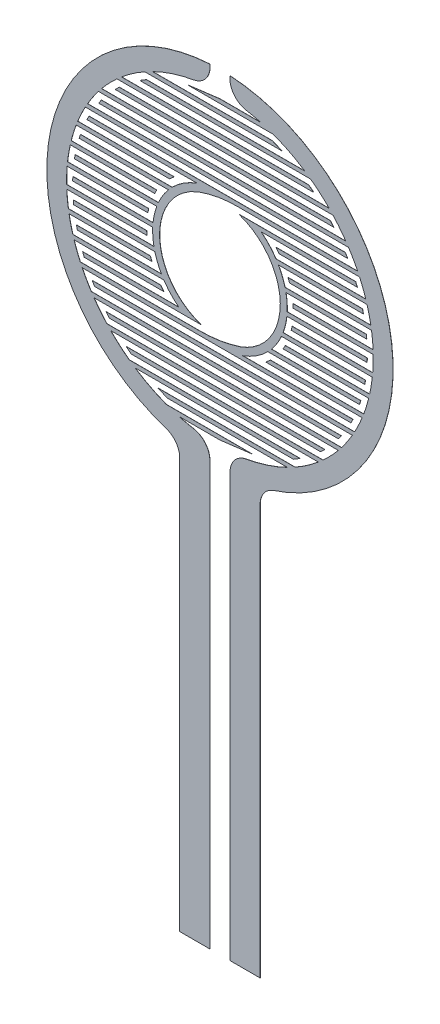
from build123d import *

# Parameters (mm, degrees)
BOSS_EXTRUDE1_DEPTH   = 0.007
BOSS_EXTRUDE1_2_DEPTH = 0.007


with BuildPart() as part:
    # Sketch1 → Boss-Extrude1 (new body)
    with BuildSketch(Plane.XY):
        with BuildLine():
            Line((-1.055500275, -3.2004), (-7.058324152, -3.2004))
            ThreePointArc((-7.058324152, -3.2004), (-7.227160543, -2.798329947), (-7.373114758, -2.3874))
            Line((-7.373114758, -2.3874), (-2.833257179, -2.3874))
            ThreePointArc((-2.833257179, -2.3874), (-2.914676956, -2.287287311), (-2.99256105, -2.1844))
            Line((-2.99256105, -2.1844), (-7.43578487, -2.1844))
            ThreePointArc((-7.43578487, -2.1844), (-7.5427027, -1.780487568), (-7.627697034, -1.3714))
            Line((-7.627697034, -1.3714), (-3.441843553, -1.3714))
            ThreePointArc((-3.441843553, -1.3714), (-3.480374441, -1.270440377), (-3.515944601, -1.1684))
            Line((-3.515944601, -1.1684), (-7.661419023, -1.1684))
            ThreePointArc((-7.661419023, -1.1684), (-7.712353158, -0.762960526), (-7.741846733, -0.3554))
            Line((-7.741846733, -0.3554), (-3.687914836, -0.3554))
            ThreePointArc((-3.687914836, -0.3554), (-3.696283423, -0.253995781), (-3.701864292, -0.1524))
            Line((-3.701864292, -0.1524), (-7.748501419, -0.1524))
            ThreePointArc((-7.748501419, -0.1524), (-7.745825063, 0.254350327), (-7.721811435, 0.6604))
            Line((-7.721811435, 0.6604), (-3.64566823, 0.6604))
            ThreePointArc((-3.64566823, 0.6604), (-3.625752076, 0.762198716), (-3.602993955, 0.8634))
            Line((-3.602993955, 0.8634), (-7.701755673, 0.8634))
            ThreePointArc((-7.701755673, 0.8634), (-7.644951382, 1.271699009), (-7.566517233, 1.6764))
            Line((-7.566517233, 1.6764), (-3.304044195, 1.6764))
            ThreePointArc((-3.304044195, 1.6764), (-3.250078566, 1.77876764), (-3.192942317, 1.8794))
            Line((-3.192942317, 1.8794), (-7.518667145, 1.8794))
            ThreePointArc((-7.518667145, 1.8794), (-7.404145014, 2.289352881), (-7.267288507, 2.6924))
            Line((-7.267288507, 2.6924), (-2.545192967, 2.6924))
            ThreePointArc((-2.545192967, 2.6924), (-2.430537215, 2.796339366), (-2.311640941, 2.8954))
            Line((-2.311640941, 2.8954), (-7.188821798, 2.8954))
            ThreePointArc((-7.188821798, 2.8954), (-7.008791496, 3.307467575), (-6.805164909, 3.7084))
            Line((-6.805164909, 3.7084), (6.455679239, 3.7084))
            Line((6.455679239, 3.7084), (6.334743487, 3.9114))
            Line((6.334743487, 3.9114), (-6.690549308, 3.9114))
            ThreePointArc((-6.690549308, 3.9114), (-6.429885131, 4.326554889), (-6.143496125, 4.7244))
            Line((-6.143496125, 4.7244), (5.753961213, 4.7244))
            ThreePointArc((5.753961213, 4.7244), (5.668442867, 4.826673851), (5.581106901, 4.9274))
            Line((5.581106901, 4.9274), (-5.981908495, 4.9274))
            ThreePointArc((-5.981908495, 4.9274), (-5.609081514, 5.347962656), (-5.20675598, 5.7404))
            Line((-5.20675598, 5.7404), (4.740868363, 5.7404))
            ThreePointArc((4.740868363, 5.7404), (4.613426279, 5.843314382), (4.483750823, 5.9434))
            Line((4.483750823, 5.9434), (-4.9737809, 5.9434))
            ThreePointArc((-4.9737809, 5.9434), (-4.40395093, 6.377124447), (-3.796519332, 6.7564))
            Line((-3.796519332, 6.7564), (3.127152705, 6.7564))
            ThreePointArc((3.127152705, 6.7564), (2.887742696, 6.862140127), (2.644764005, 6.9594))
            Line((2.644764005, 6.9594), (-3.410168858, 6.9594))
            ThreePointArc((-3.410168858, 6.9594), (-2.393348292, 7.371186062), (-1.328571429, 7.635273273))
            ThreePointArc((-1.328571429, 7.635273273), (-0.734680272, 7.97681952), (-0.5, 8.620469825))
            Line((-0.5, 8.620469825), (-0.5, 8.735702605))
            ThreePointArc((-0.5, 8.735702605), (-8.676707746, 1.130151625), (-2.721025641, -8.316160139))
            ThreePointArc((-2.721025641, -8.316160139), (-2.222378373, -8.679626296), (-2.032, -9.266578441))
            Line((-2.032, -9.266578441), (-2.032, -29.999750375))
            Line((-2.032, -29.999750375), (-0.508, -29.999750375))
            Line((-0.508, -29.999750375), (-0.508, -8.619073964))
            ThreePointArc((-0.508, -8.619073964), (-0.742381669, -7.975778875), (-1.335657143, -7.63403694))
            ThreePointArc((-1.335657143, -7.63403694), (-1.706738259, -7.559731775), (-2.073749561, -7.4674))
            Line((-2.073749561, -7.4674), (0, -7.4674))
            Line((0, -7.4674), (1.629882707, -7.2644))
            Line((1.629882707, -7.2644), (-2.700183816, -7.2644))
            ThreePointArc((-2.700183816, -7.2644), (-3.520840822, -6.904069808), (-4.294407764, -6.4514))
            Line((-4.294407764, -6.4514), (3.71583948, -6.4514))
            ThreePointArc((3.71583948, -6.4514), (3.883198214, -6.352070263), (4.047903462, -6.2484))
            Line((4.047903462, -6.2484), (-4.584757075, -6.2484))
            ThreePointArc((-4.584757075, -6.2484), (-5.070894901, -5.860761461), (-5.524393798, -5.4354))
            Line((-5.524393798, -5.4354), (5.087676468, -5.4354))
            ThreePointArc((5.087676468, -5.4354), (5.19294353, -5.334919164), (5.29622651, -5.2324))
            Line((5.29622651, -5.2324), (-5.717035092, -5.2324))
            ThreePointArc((-5.717035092, -5.2324), (-6.055391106, -4.836810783), (-6.366427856, -4.4194))
            Line((-6.366427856, -4.4194), (5.991404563, -4.4194))
            ThreePointArc((5.991404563, -4.4194), (6.064531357, -4.318504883), (6.13595926, -4.2164))
            Line((6.13595926, -4.2164), (-6.502651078, -4.2164))
            ThreePointArc((-6.502651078, -4.2164), (-6.744942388, -3.816837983), (-6.962712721, -3.4034))
            Line((-6.962712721, -3.4034), (6.621547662, -3.4034))
            Line((6.621547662, -3.4034), (6.722013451, -3.2004))
            Line((6.722013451, -3.2004), (1.147797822, -3.2004))
            ThreePointArc((1.147797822, -3.2004), (1.830022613, -2.86548726), (2.420810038, -2.3874))
            Line((2.420810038, -2.3874), (7.051832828, -2.3874))
            Line((7.051832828, -2.3874), (7.117332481, -2.1844))
            Line((7.117332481, -2.1844), (2.605455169, -2.1844))
            ThreePointArc((2.605455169, -2.1844), (2.887064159, -1.79578967), (3.11115124, -1.3714))
            Line((3.11115124, -1.3714), (7.317601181, -1.3714))
            Line((7.317601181, -1.3714), (7.352745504, -1.1684))
            Line((7.352745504, -1.1684), (3.192936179, -1.1684))
            ThreePointArc((3.192936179, -1.1684), (3.312194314, -0.767703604), (3.381374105, -0.3554))
            Line((3.381374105, -0.3554), (7.436512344, -0.3554))
            Line((7.436512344, -0.3554), (7.443440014, -0.1524))
            Line((7.443440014, -0.1524), (3.39658273, -0.1524))
            ThreePointArc((3.39658273, -0.1524), (3.390360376, 0.255844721), (3.335246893, 0.6604))
            Line((3.335246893, 0.6604), (7.415652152, 0.6604))
            Line((7.415652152, 0.6604), (7.394766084, 0.8634))
            Line((7.394766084, 0.8634), (3.288546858, 0.8634))
            ThreePointArc((3.288546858, 0.8634), (3.149608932, 1.280610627), (2.957986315, 1.6764))
            Line((2.957986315, 1.6764), (7.253806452, 1.6764))
            Line((7.253806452, 1.6764), (7.203879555, 1.8794))
            Line((7.203879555, 1.8794), (2.833347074, 1.8794))
            ThreePointArc((2.833347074, 1.8794), (2.488247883, 2.317028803), (2.0762905, 2.6924))
            Line((2.0762905, 2.6924), (6.941109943, 2.6924))
            Line((6.941109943, 2.6924), (6.85891273, 2.8954))
            Line((6.85891273, 2.8954), (0.958727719, 2.8954))
            ThreePointArc((0.958727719, 2.8954), (3.049769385, 0.037506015), (1.029642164, -2.870947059))
            ThreePointArc((1.029642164, -2.870947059), (0.000625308, -3.12146053), (-1.055500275, -3.2004))
        make_face()
    extrude(amount=BOSS_EXTRUDE1_DEPTH)


with BuildPart() as body_2:
    # Sketch1 → Boss-Extrude1 2 (new body)
    with BuildSketch(Plane.XY):
        with BuildLine():
            Line((0.508, -29.999750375), (0.508, -8.619073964))
            ThreePointArc((0.508, -8.619073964), (0.742381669, -7.975778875), (1.335657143, -7.63403694))
            ThreePointArc((1.335657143, -7.63403694), (2.396768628, -7.370074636), (3.410168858, -6.9594))
            Line((3.410168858, -6.9594), (-2.644764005, -6.9594))
            ThreePointArc((-2.644764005, -6.9594), (-2.887742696, -6.862140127), (-3.127152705, -6.7564))
            Line((-3.127152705, -6.7564), (3.796519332, -6.7564))
            ThreePointArc((3.796519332, -6.7564), (4.40395093, -6.377124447), (4.9737809, -5.9434))
            Line((4.9737809, -5.9434), (-4.483750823, -5.9434))
            ThreePointArc((-4.483750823, -5.9434), (-4.613426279, -5.843314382), (-4.740868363, -5.7404))
            Line((-4.740868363, -5.7404), (5.20675598, -5.7404))
            ThreePointArc((5.20675598, -5.7404), (5.609081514, -5.347962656), (5.981908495, -4.9274))
            Line((5.981908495, -4.9274), (-5.581106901, -4.9274))
            ThreePointArc((-5.581106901, -4.9274), (-5.668442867, -4.826673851), (-5.753961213, -4.7244))
            Line((-5.753961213, -4.7244), (6.143496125, -4.7244))
            ThreePointArc((6.143496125, -4.7244), (6.429885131, -4.326554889), (6.690549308, -3.9114))
            Line((6.690549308, -3.9114), (-6.334743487, -3.9114))
            Line((-6.334743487, -3.9114), (-6.455679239, -3.7084))
            Line((-6.455679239, -3.7084), (6.805164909, -3.7084))
            ThreePointArc((6.805164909, -3.7084), (7.008791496, -3.307467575), (7.188821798, -2.8954))
            Line((7.188821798, -2.8954), (2.311640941, -2.8954))
            ThreePointArc((2.311640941, -2.8954), (2.430537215, -2.796339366), (2.545192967, -2.6924))
            Line((2.545192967, -2.6924), (7.267288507, -2.6924))
            ThreePointArc((7.267288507, -2.6924), (7.404145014, -2.289352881), (7.518667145, -1.8794))
            Line((7.518667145, -1.8794), (3.192942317, -1.8794))
            ThreePointArc((3.192942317, -1.8794), (3.250078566, -1.77876764), (3.304044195, -1.6764))
            Line((3.304044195, -1.6764), (7.566517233, -1.6764))
            ThreePointArc((7.566517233, -1.6764), (7.644951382, -1.271699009), (7.701755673, -0.8634))
            Line((7.701755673, -0.8634), (3.602993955, -0.8634))
            ThreePointArc((3.602993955, -0.8634), (3.625752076, -0.762198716), (3.64566823, -0.6604))
            Line((3.64566823, -0.6604), (7.721811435, -0.6604))
            ThreePointArc((7.721811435, -0.6604), (7.745825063, -0.254350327), (7.748501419, 0.1524))
            Line((7.748501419, 0.1524), (3.701864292, 0.1524))
            ThreePointArc((3.701864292, 0.1524), (3.696283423, 0.253995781), (3.687914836, 0.3554))
            Line((3.687914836, 0.3554), (7.741846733, 0.3554))
            ThreePointArc((7.741846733, 0.3554), (7.712353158, 0.762960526), (7.661419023, 1.1684))
            Line((7.661419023, 1.1684), (3.515944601, 1.1684))
            ThreePointArc((3.515944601, 1.1684), (3.480374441, 1.270440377), (3.441843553, 1.3714))
            Line((3.441843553, 1.3714), (7.627697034, 1.3714))
            ThreePointArc((7.627697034, 1.3714), (7.5427027, 1.780487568), (7.43578487, 2.1844))
            Line((7.43578487, 2.1844), (2.99256105, 2.1844))
            ThreePointArc((2.99256105, 2.1844), (2.914676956, 2.287287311), (2.833257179, 2.3874))
            Line((2.833257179, 2.3874), (7.373114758, 2.3874))
            ThreePointArc((7.373114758, 2.3874), (7.227160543, 2.798329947), (7.058324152, 3.2004))
            Line((7.058324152, 3.2004), (0.958727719, 3.2004))
            ThreePointArc((0.958727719, 3.2004), (-0.050561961, 3.126836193), (-1.029642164, 2.870947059))
            ThreePointArc((-1.029642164, 2.870947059), (-1.28244772, 2.759921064), (-1.530327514, 2.638294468))
            ThreePointArc((-1.530327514, 2.638294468), (-3.03385771, -0.313380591), (-0.958727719, -2.8954))
            Line((-0.958727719, -2.8954), (-6.85891273, -2.8954))
            Line((-6.85891273, -2.8954), (-6.941109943, -2.6924))
            Line((-6.941109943, -2.6924), (-2.0762905, -2.6924))
            ThreePointArc((-2.0762905, -2.6924), (-2.488247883, -2.317028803), (-2.833347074, -1.8794))
            Line((-2.833347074, -1.8794), (-7.203879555, -1.8794))
            Line((-7.203879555, -1.8794), (-7.253806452, -1.6764))
            Line((-7.253806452, -1.6764), (-2.957986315, -1.6764))
            ThreePointArc((-2.957986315, -1.6764), (-3.149608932, -1.280610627), (-3.288546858, -0.8634))
            Line((-3.288546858, -0.8634), (-7.394766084, -0.8634))
            Line((-7.394766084, -0.8634), (-7.415652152, -0.6604))
            Line((-7.415652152, -0.6604), (-3.335246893, -0.6604))
            ThreePointArc((-3.335246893, -0.6604), (-3.390360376, -0.255844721), (-3.39658273, 0.1524))
            Line((-3.39658273, 0.1524), (-7.443440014, 0.1524))
            Line((-7.443440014, 0.1524), (-7.436512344, 0.3554))
            Line((-7.436512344, 0.3554), (-3.381374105, 0.3554))
            ThreePointArc((-3.381374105, 0.3554), (-3.312194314, 0.767703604), (-3.192936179, 1.1684))
            Line((-3.192936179, 1.1684), (-7.352745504, 1.1684))
            Line((-7.352745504, 1.1684), (-7.317601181, 1.3714))
            Line((-7.317601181, 1.3714), (-3.11115124, 1.3714))
            ThreePointArc((-3.11115124, 1.3714), (-2.887064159, 1.79578967), (-2.605455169, 2.1844))
            Line((-2.605455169, 2.1844), (-7.117332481, 2.1844))
            Line((-7.117332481, 2.1844), (-7.051832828, 2.3874))
            Line((-7.051832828, 2.3874), (-2.420810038, 2.3874))
            ThreePointArc((-2.420810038, 2.3874), (-1.830022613, 2.86548726), (-1.147797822, 3.2004))
            Line((-1.147797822, 3.2004), (-6.722013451, 3.2004))
            Line((-6.722013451, 3.2004), (-6.621547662, 3.4034))
            Line((-6.621547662, 3.4034), (6.962712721, 3.4034))
            ThreePointArc((6.962712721, 3.4034), (6.744942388, 3.816837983), (6.502651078, 4.2164))
            Line((6.502651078, 4.2164), (-6.13595926, 4.2164))
            ThreePointArc((-6.13595926, 4.2164), (-6.064531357, 4.318504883), (-5.991404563, 4.4194))
            Line((-5.991404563, 4.4194), (6.366427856, 4.4194))
            ThreePointArc((6.366427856, 4.4194), (6.055391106, 4.836810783), (5.717035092, 5.2324))
            Line((5.717035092, 5.2324), (-5.29622651, 5.2324))
            ThreePointArc((-5.29622651, 5.2324), (-5.19294353, 5.334919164), (-5.087676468, 5.4354))
            Line((-5.087676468, 5.4354), (5.524393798, 5.4354))
            ThreePointArc((5.524393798, 5.4354), (5.070894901, 5.860761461), (4.584757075, 6.2484))
            Line((4.584757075, 6.2484), (-4.047903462, 6.2484))
            ThreePointArc((-4.047903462, 6.2484), (-3.883198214, 6.352070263), (-3.71583948, 6.4514))
            Line((-3.71583948, 6.4514), (4.294407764, 6.4514))
            ThreePointArc((4.294407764, 6.4514), (3.520840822, 6.904069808), (2.700183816, 7.2644))
            Line((2.700183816, 7.2644), (-1.629882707, 7.2644))
            Line((-1.629882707, 7.2644), (0, 7.4674))
            Line((0, 7.4674), (2.073749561, 7.4674))
            ThreePointArc((2.073749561, 7.4674), (1.703229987, 7.560522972), (1.328571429, 7.635273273))
            ThreePointArc((1.328571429, 7.635273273), (0.734680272, 7.97681952), (0.5, 8.620469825))
            Line((0.5, 8.620469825), (0.5, 8.735702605))
            ThreePointArc((0.5, 8.735702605), (8.676707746, 1.130151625), (2.721025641, -8.316160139))
            ThreePointArc((2.721025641, -8.316160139), (2.222378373, -8.679626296), (2.032, -9.266578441))
            Line((2.032, -9.266578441), (2.032, -29.999750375))
            Line((2.032, -29.999750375), (0.508, -29.999750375))
        make_face()
    extrude(amount=BOSS_EXTRUDE1_2_DEPTH)


solid = Compound([part.part, body_2.part])
